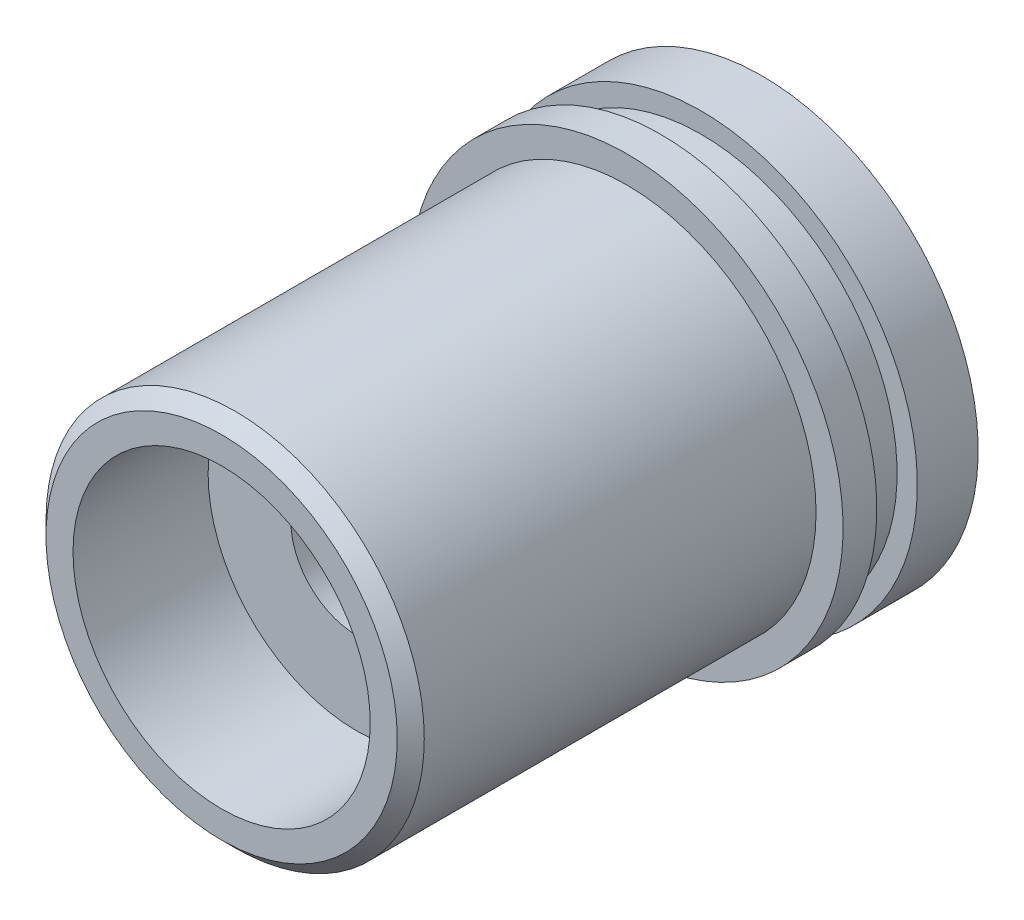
ISO-10303-21;
HEADER;
FILE_DESCRIPTION(('STEP AP214'),'2;1');
FILE_NAME('part.step','',(''),(''),'','','');
FILE_SCHEMA(('AUTOMOTIVE_DESIGN { 1 0 10303 214 1 1 1 1 }'));
ENDSEC;
DATA;
#1=APPLICATION_CONTEXT('core data for automotive mechanical design processes');
#2=APPLICATION_PROTOCOL_DEFINITION('international standard','automotive_design',2000,#1);
#3=PRODUCT_CONTEXT('',#1,'mechanical');
#4=PRODUCT('Part','Part','',(#3));
#5=PRODUCT_RELATED_PRODUCT_CATEGORY('part','',(#4));
#6=PRODUCT_DEFINITION_FORMATION('','',#4);
#7=PRODUCT_DEFINITION_CONTEXT('part definition',#1,'design');
#8=PRODUCT_DEFINITION('design','',#6,#7);
#9=PRODUCT_DEFINITION_SHAPE('','',#8);
#10=(LENGTH_UNIT() NAMED_UNIT(*) SI_UNIT(.MILLI.,.METRE.));
#11=(NAMED_UNIT(*) PLANE_ANGLE_UNIT() SI_UNIT($,.RADIAN.));
#12=(NAMED_UNIT(*) SI_UNIT($,.STERADIAN.) SOLID_ANGLE_UNIT());
#13=UNCERTAINTY_MEASURE_WITH_UNIT(LENGTH_MEASURE(1.E-05),#10,'distance_accuracy_value','');
#14=(GEOMETRIC_REPRESENTATION_CONTEXT(3) GLOBAL_UNCERTAINTY_ASSIGNED_CONTEXT((#13)) GLOBAL_UNIT_ASSIGNED_CONTEXT((#10,
#11,#12)) REPRESENTATION_CONTEXT('',''));
#15=CARTESIAN_POINT('',(0.,0.,0.));
#16=DIRECTION('',(0.,0.,1.));
#17=DIRECTION('',(1.,0.,0.));
#18=AXIS2_PLACEMENT_3D('',#15,#16,#17);
#19=CARTESIAN_POINT('',(0.,0.,20.));
#20=DIRECTION('',(0.,0.,-1.));
#21=DIRECTION('',(-1.,0.,0.));
#22=AXIS2_PLACEMENT_3D('',#19,#20,#21);
#23=CONICAL_SURFACE('',#22,4.87534009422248,0.08726646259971);
#24=CARTESIAN_POINT('',(0.,0.,-10.));
#25=DIRECTION('',(0.,0.,-1.));
#26=DIRECTION('',(-1.,0.,0.));
#27=AXIS2_PLACEMENT_3D('',#24,#25,#26);
#28=CIRCLE('',#27,7.5);
#29=CARTESIAN_POINT('',(-7.5,0.,-10.));
#30=VERTEX_POINT('',#29);
#31=EDGE_CURVE('E49',#30,#30,#28,.T.);
#32=ORIENTED_EDGE('',*,*,#31,.T.);
#33=EDGE_LOOP('',(#32));
#34=FACE_BOUND('',#33,.T.);
#35=CARTESIAN_POINT('',(0.,0.,20.));
#36=DIRECTION('',(0.,0.,-1.));
#37=DIRECTION('',(-1.,0.,0.));
#38=AXIS2_PLACEMENT_3D('',#35,#36,#37);
#39=CIRCLE('',#38,4.87534009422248);
#40=CARTESIAN_POINT('',(-4.87534009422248,0.,20.));
#41=VERTEX_POINT('',#40);
#42=EDGE_CURVE('E82',#41,#41,#39,.T.);
#43=ORIENTED_EDGE('',*,*,#42,.F.);
#44=EDGE_LOOP('',(#43));
#45=FACE_BOUND('',#44,.T.);
#46=ADVANCED_FACE('F39',(#34,#45),#23,.F.);
#47=CARTESIAN_POINT('',(-7.5,0.,-10.));
#48=DIRECTION('',(0.,0.,-1.));
#49=DIRECTION('',(-1.,0.,0.));
#50=AXIS2_PLACEMENT_3D('',#47,#48,#49);
#51=PLANE('',#50);
#52=CARTESIAN_POINT('',(0.,0.,-10.));
#53=DIRECTION('',(0.,0.,-1.));
#54=DIRECTION('',(-1.,0.,0.));
#55=AXIS2_PLACEMENT_3D('',#52,#53,#54);
#56=CIRCLE('',#55,16.);
#57=CARTESIAN_POINT('',(-16.,0.,-10.));
#58=VERTEX_POINT('',#57);
#59=EDGE_CURVE('E53',#58,#58,#56,.T.);
#60=ORIENTED_EDGE('',*,*,#59,.T.);
#61=EDGE_LOOP('',(#60));
#62=FACE_BOUND('',#61,.T.);
#63=ORIENTED_EDGE('',*,*,#31,.F.);
#64=EDGE_LOOP('',(#63));
#65=FACE_BOUND('',#64,.T.);
#66=ADVANCED_FACE('F90',(#62,#65),#51,.T.);
#67=CARTESIAN_POINT('',(0.,0.,-11.0873015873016));
#68=DIRECTION('',(0.,0.,-1.));
#69=DIRECTION('',(-1.,0.,0.));
#70=AXIS2_PLACEMENT_3D('',#67,#68,#69);
#71=CYLINDRICAL_SURFACE('',#70,16.);
#72=CARTESIAN_POINT('',(0.,0.,-5.5));
#73=DIRECTION('',(0.,0.,-1.));
#74=DIRECTION('',(-1.,0.,0.));
#75=AXIS2_PLACEMENT_3D('',#72,#73,#74);
#76=CIRCLE('',#75,16.);
#77=CARTESIAN_POINT('',(-16.,0.,-5.5));
#78=VERTEX_POINT('',#77);
#79=EDGE_CURVE('E58',#78,#78,#76,.T.);
#80=ORIENTED_EDGE('',*,*,#79,.T.);
#81=EDGE_LOOP('',(#80));
#82=FACE_BOUND('',#81,.T.);
#83=ORIENTED_EDGE('',*,*,#59,.F.);
#84=EDGE_LOOP('',(#83));
#85=FACE_BOUND('',#84,.T.);
#86=ADVANCED_FACE('F95',(#82,#85),#71,.T.);
#87=CARTESIAN_POINT('',(-16.,0.,-5.50000000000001));
#88=DIRECTION('',(0.,0.,1.));
#89=DIRECTION('',(1.,0.,0.));
#90=AXIS2_PLACEMENT_3D('',#87,#88,#89);
#91=PLANE('',#90);
#92=CARTESIAN_POINT('',(0.,0.,-5.5));
#93=DIRECTION('',(0.,0.,-1.));
#94=DIRECTION('',(-1.,0.,0.));
#95=AXIS2_PLACEMENT_3D('',#92,#93,#94);
#96=CIRCLE('',#95,14.5);
#97=CARTESIAN_POINT('',(-14.5,0.,-5.5));
#98=VERTEX_POINT('',#97);
#99=EDGE_CURVE('E61',#98,#98,#96,.T.);
#100=ORIENTED_EDGE('',*,*,#99,.T.);
#101=EDGE_LOOP('',(#100));
#102=FACE_BOUND('',#101,.T.);
#103=ORIENTED_EDGE('',*,*,#79,.F.);
#104=EDGE_LOOP('',(#103));
#105=FACE_BOUND('',#104,.T.);
#106=ADVANCED_FACE('F102',(#102,#105),#91,.T.);
#107=CARTESIAN_POINT('',(0.,0.,-11.0873015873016));
#108=DIRECTION('',(0.,0.,-1.));
#109=DIRECTION('',(-1.,0.,0.));
#110=AXIS2_PLACEMENT_3D('',#107,#108,#109);
#111=CYLINDRICAL_SURFACE('',#110,14.5);
#112=CARTESIAN_POINT('',(0.,0.,-2.5));
#113=DIRECTION('',(0.,0.,-1.));
#114=DIRECTION('',(-1.,0.,0.));
#115=AXIS2_PLACEMENT_3D('',#112,#113,#114);
#116=CIRCLE('',#115,14.5);
#117=CARTESIAN_POINT('',(-14.5,0.,-2.5));
#118=VERTEX_POINT('',#117);
#119=EDGE_CURVE('E64',#118,#118,#116,.T.);
#120=ORIENTED_EDGE('',*,*,#119,.T.);
#121=EDGE_LOOP('',(#120));
#122=FACE_BOUND('',#121,.T.);
#123=ORIENTED_EDGE('',*,*,#99,.F.);
#124=EDGE_LOOP('',(#123));
#125=FACE_BOUND('',#124,.T.);
#126=ADVANCED_FACE('F108',(#122,#125),#111,.T.);
#127=CARTESIAN_POINT('',(-14.5,0.,-2.5));
#128=DIRECTION('',(0.,0.,-1.));
#129=DIRECTION('',(-1.,0.,0.));
#130=AXIS2_PLACEMENT_3D('',#127,#128,#129);
#131=PLANE('',#130);
#132=CARTESIAN_POINT('',(0.,0.,-2.5));
#133=DIRECTION('',(0.,0.,-1.));
#134=DIRECTION('',(-1.,0.,0.));
#135=AXIS2_PLACEMENT_3D('',#132,#133,#134);
#136=CIRCLE('',#135,16.);
#137=CARTESIAN_POINT('',(-16.,0.,-2.5));
#138=VERTEX_POINT('',#137);
#139=EDGE_CURVE('E67',#138,#138,#136,.T.);
#140=ORIENTED_EDGE('',*,*,#139,.T.);
#141=EDGE_LOOP('',(#140));
#142=FACE_BOUND('',#141,.T.);
#143=ORIENTED_EDGE('',*,*,#119,.F.);
#144=EDGE_LOOP('',(#143));
#145=FACE_BOUND('',#144,.T.);
#146=ADVANCED_FACE('F112',(#142,#145),#131,.T.);
#147=CARTESIAN_POINT('',(0.,0.,-11.0873015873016));
#148=DIRECTION('',(0.,0.,-1.));
#149=DIRECTION('',(-1.,0.,0.));
#150=AXIS2_PLACEMENT_3D('',#147,#148,#149);
#151=CYLINDRICAL_SURFACE('',#150,16.);
#152=CARTESIAN_POINT('',(0.,0.,0.));
#153=DIRECTION('',(0.,0.,-1.));
#154=DIRECTION('',(-1.,0.,0.));
#155=AXIS2_PLACEMENT_3D('',#152,#153,#154);
#156=CIRCLE('',#155,16.);
#157=CARTESIAN_POINT('',(-16.,0.,0.));
#158=VERTEX_POINT('',#157);
#159=EDGE_CURVE('E70',#158,#158,#156,.T.);
#160=ORIENTED_EDGE('',*,*,#159,.T.);
#161=EDGE_LOOP('',(#160));
#162=FACE_BOUND('',#161,.T.);
#163=ORIENTED_EDGE('',*,*,#139,.F.);
#164=EDGE_LOOP('',(#163));
#165=FACE_BOUND('',#164,.T.);
#166=ADVANCED_FACE('F116',(#162,#165),#151,.T.);
#167=CARTESIAN_POINT('',(-16.,0.,0.));
#168=DIRECTION('',(0.,0.,1.));
#169=DIRECTION('',(1.,0.,0.));
#170=AXIS2_PLACEMENT_3D('',#167,#168,#169);
#171=PLANE('',#170);
#172=CARTESIAN_POINT('',(0.,0.,0.));
#173=DIRECTION('',(0.,0.,-1.));
#174=DIRECTION('',(-1.,0.,0.));
#175=AXIS2_PLACEMENT_3D('',#172,#173,#174);
#176=CIRCLE('',#175,14.);
#177=CARTESIAN_POINT('',(-14.,0.,0.));
#178=VERTEX_POINT('',#177);
#179=EDGE_CURVE('E73',#178,#178,#176,.T.);
#180=ORIENTED_EDGE('',*,*,#179,.T.);
#181=EDGE_LOOP('',(#180));
#182=FACE_BOUND('',#181,.T.);
#183=ORIENTED_EDGE('',*,*,#159,.F.);
#184=EDGE_LOOP('',(#183));
#185=FACE_BOUND('',#184,.T.);
#186=ADVANCED_FACE('F120',(#182,#185),#171,.T.);
#187=CARTESIAN_POINT('',(0.,0.,-11.0873015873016));
#188=DIRECTION('',(0.,0.,-1.));
#189=DIRECTION('',(-1.,0.,0.));
#190=AXIS2_PLACEMENT_3D('',#187,#188,#189);
#191=CYLINDRICAL_SURFACE('',#190,14.);
#192=CARTESIAN_POINT('',(0.,0.,29.));
#193=DIRECTION('',(0.,0.,1.));
#194=DIRECTION('',(1.,0.,0.));
#195=AXIS2_PLACEMENT_3D('',#192,#193,#194);
#196=CIRCLE('',#195,14.);
#197=CARTESIAN_POINT('',(14.,0.,29.));
#198=VERTEX_POINT('',#197);
#199=EDGE_CURVE('E45',#198,#198,#196,.F.);
#200=ORIENTED_EDGE('',*,*,#199,.T.);
#201=EDGE_LOOP('',(#200));
#202=FACE_BOUND('',#201,.T.);
#203=ORIENTED_EDGE('',*,*,#179,.F.);
#204=EDGE_LOOP('',(#203));
#205=FACE_BOUND('',#204,.T.);
#206=ADVANCED_FACE('F124',(#202,#205),#191,.T.);
#207=CARTESIAN_POINT('',(-14.,0.,30.));
#208=DIRECTION('',(0.,0.,1.));
#209=DIRECTION('',(1.,0.,0.));
#210=AXIS2_PLACEMENT_3D('',#207,#208,#209);
#211=PLANE('',#210);
#212=CARTESIAN_POINT('',(0.,0.,30.));
#213=DIRECTION('',(0.,0.,1.));
#214=DIRECTION('',(1.,0.,0.));
#215=AXIS2_PLACEMENT_3D('',#212,#213,#214);
#216=CIRCLE('',#215,13.);
#217=CARTESIAN_POINT('',(13.,0.,30.));
#218=VERTEX_POINT('',#217);
#219=EDGE_CURVE('E10',#218,#218,#216,.T.);
#220=ORIENTED_EDGE('',*,*,#219,.T.);
#221=EDGE_LOOP('',(#220));
#222=FACE_BOUND('',#221,.T.);
#223=CARTESIAN_POINT('',(0.,0.,30.));
#224=DIRECTION('',(0.,0.,-1.));
#225=DIRECTION('',(-1.,0.,0.));
#226=AXIS2_PLACEMENT_3D('',#223,#224,#225);
#227=CIRCLE('',#226,11.);
#228=CARTESIAN_POINT('',(-11.,0.,30.));
#229=VERTEX_POINT('',#228);
#230=EDGE_CURVE('E76',#229,#229,#227,.T.);
#231=ORIENTED_EDGE('',*,*,#230,.T.);
#232=EDGE_LOOP('',(#231));
#233=FACE_BOUND('',#232,.T.);
#234=ADVANCED_FACE('F128',(#222,#233),#211,.T.);
#235=CARTESIAN_POINT('',(0.,0.,-11.0873015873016));
#236=DIRECTION('',(0.,0.,-1.));
#237=DIRECTION('',(-1.,0.,0.));
#238=AXIS2_PLACEMENT_3D('',#235,#236,#237);
#239=CYLINDRICAL_SURFACE('',#238,11.);
#240=CARTESIAN_POINT('',(0.,0.,20.));
#241=DIRECTION('',(0.,0.,-1.));
#242=DIRECTION('',(-1.,0.,0.));
#243=AXIS2_PLACEMENT_3D('',#240,#241,#242);
#244=CIRCLE('',#243,11.);
#245=CARTESIAN_POINT('',(-11.,0.,20.));
#246=VERTEX_POINT('',#245);
#247=EDGE_CURVE('E79',#246,#246,#244,.T.);
#248=ORIENTED_EDGE('',*,*,#247,.T.);
#249=EDGE_LOOP('',(#248));
#250=FACE_BOUND('',#249,.T.);
#251=ORIENTED_EDGE('',*,*,#230,.F.);
#252=EDGE_LOOP('',(#251));
#253=FACE_BOUND('',#252,.T.);
#254=ADVANCED_FACE('F131',(#250,#253),#239,.F.);
#255=CARTESIAN_POINT('',(-11.,0.,20.));
#256=DIRECTION('',(0.,0.,1.));
#257=DIRECTION('',(1.,0.,0.));
#258=AXIS2_PLACEMENT_3D('',#255,#256,#257);
#259=PLANE('',#258);
#260=ORIENTED_EDGE('',*,*,#42,.T.);
#261=EDGE_LOOP('',(#260));
#262=FACE_BOUND('',#261,.T.);
#263=ORIENTED_EDGE('',*,*,#247,.F.);
#264=EDGE_LOOP('',(#263));
#265=FACE_BOUND('',#264,.T.);
#266=ADVANCED_FACE('F86',(#262,#265),#259,.T.);
#267=CARTESIAN_POINT('',(0.,0.,29.));
#268=DIRECTION('',(0.,0.,-1.));
#269=DIRECTION('',(-1.,0.,0.));
#270=AXIS2_PLACEMENT_3D('',#267,#268,#269);
#271=CONICAL_SURFACE('',#270,14.,0.785398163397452);
#272=ORIENTED_EDGE('',*,*,#219,.F.);
#273=EDGE_LOOP('',(#272));
#274=FACE_BOUND('',#273,.T.);
#275=ORIENTED_EDGE('',*,*,#199,.F.);
#276=EDGE_LOOP('',(#275));
#277=FACE_BOUND('',#276,.T.);
#278=ADVANCED_FACE('F137',(#274,#277),#271,.T.);
#279=CLOSED_SHELL('',(#46,#66,#86,#106,#126,#146,#166,#186,#206,#234,#254,#266,#278));
#280=MANIFOLD_SOLID_BREP('B2',#279);
#281=ADVANCED_BREP_SHAPE_REPRESENTATION('',(#18,#280),#14);
#282=SHAPE_DEFINITION_REPRESENTATION(#9,#281);
ENDSEC;
END-ISO-10303-21;
